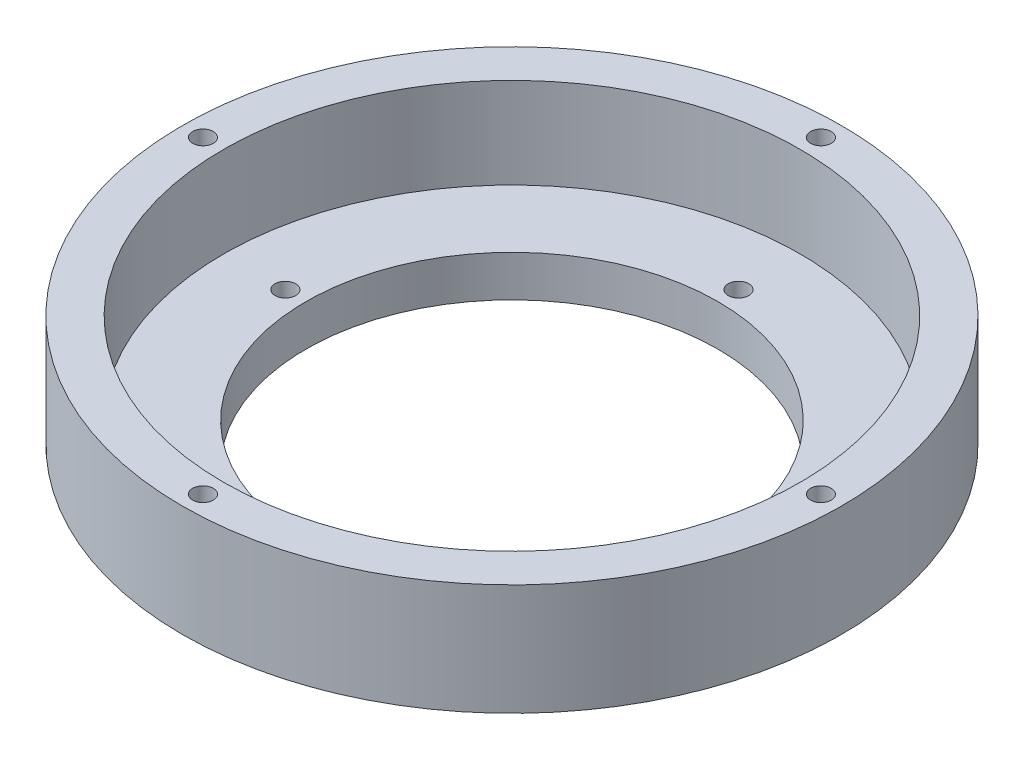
from build123d import *

# Parameters (mm, degrees)
SKETCH2_R           = 60
SKETCH2_R_2         = 50
BOSS_EXTRUDE1_DEPTH = 5
SKETCH7_R           = 80
SKETCH7_R_2         = 50
BOSS_EXTRUDE2_DEPTH = 5
SKETCH8_R           = 80
SKETCH8_R_2         = 70
BOSS_EXTRUDE3_DEPTH = 22
CUT_EXTRUDE3_REACH  = 119.576
SKETCH4_R           = 2.5
SKETCH9_R           = 2.5
CUT_EXTRUDE4_DEPTH  = 10


with BuildPart() as part:
    # Sketch2 → Boss-Extrude1 (new body)
    with BuildSketch(Plane(origin=(0, 0, 0), x_dir=(1, 0, 0), z_dir=(0, 1, 0))):
        with Locations(Location((0, 0, 0), (0, 0, 270))):
            Circle(SKETCH2_R)
        with Locations(Location((0, 0, 0), (0, 0, 270))):
            Circle(SKETCH2_R_2, mode=Mode.SUBTRACT)
    extrude(amount=BOSS_EXTRUDE1_DEPTH)

    # Sketch7 → Boss-Extrude2 (add)
    with BuildSketch(Plane(origin=(0, 5, 0), x_dir=(1, 0, 0), z_dir=(0, 1, 0))):
        with Locations(Location((0, 0, 0), (0, 0, 270))):
            Circle(SKETCH7_R)
        with Locations(Location((0, 0, 0), (0, 0, 270))):
            Circle(SKETCH7_R_2, mode=Mode.SUBTRACT)
    extrude(amount=BOSS_EXTRUDE2_DEPTH)

    # Sketch8 → Boss-Extrude3 (add)
    with BuildSketch(Plane(origin=(0, 10, 0), x_dir=(1, 0, 0), z_dir=(0, 1, 0))):
        with Locations(Location((0, 0, 0), (0, 0, 270))):
            Circle(SKETCH8_R)
        with Locations(Location((0, 0, 0), (0, 0, 270))):
            Circle(SKETCH8_R_2, mode=Mode.SUBTRACT)
    extrude(amount=BOSS_EXTRUDE3_DEPTH)

    # Sketch4 → Cut-Extrude3 (cut, up to next)
    with BuildSketch(Plane.XZ, mode=Mode.PRIVATE) as cut_extrude3_sk1:
        with Locations(Location((-55, 0, 0), (0, 0, 270))):
            Circle(SKETCH4_R)
    cut_extrude3_tool1 = extrude(cut_extrude3_sk1.sketch, amount=-CUT_EXTRUDE3_REACH, mode=Mode.PRIVATE) & part.part
    # Sketch4 → Cut-Extrude3 (cut, up to next)
    with BuildSketch(Plane.XZ, mode=Mode.PRIVATE) as cut_extrude3_sk2:
        with Locations(Location((0, 55, 0), (0, 0, 270))):
            Circle(SKETCH4_R)
    cut_extrude3_tool2 = extrude(cut_extrude3_sk2.sketch, amount=-CUT_EXTRUDE3_REACH, mode=Mode.PRIVATE) & part.part
    # Sketch4 → Cut-Extrude3 (cut, up to next)
    with BuildSketch(Plane.XZ, mode=Mode.PRIVATE) as cut_extrude3_sk3:
        with Locations(Location((0, -55, 0), (0, 0, 270))):
            Circle(SKETCH4_R)
    cut_extrude3_tool3 = extrude(cut_extrude3_sk3.sketch, amount=-CUT_EXTRUDE3_REACH, mode=Mode.PRIVATE) & part.part
    # Sketch4 → Cut-Extrude3 (cut, up to next)
    with BuildSketch(Plane.XZ, mode=Mode.PRIVATE) as cut_extrude3_sk4:
        with Locations(Location((55, 0, 0), (0, 0, 270))):
            Circle(SKETCH4_R)
    cut_extrude3_tool4 = extrude(cut_extrude3_sk4.sketch, amount=-CUT_EXTRUDE3_REACH, mode=Mode.PRIVATE) & part.part
    add(cut_extrude3_tool1.solids().sort_by_distance((-55, 0, 0))[0], mode=Mode.SUBTRACT)
    add(cut_extrude3_tool2.solids().sort_by_distance((0, 0, 55))[0], mode=Mode.SUBTRACT)
    add(cut_extrude3_tool3.solids().sort_by_distance((0, 0, -55))[0], mode=Mode.SUBTRACT)
    add(cut_extrude3_tool4.solids().sort_by_distance((55, 0, 0))[0], mode=Mode.SUBTRACT)

    # Sketch9 → Cut-Extrude4 (cut)
    with BuildSketch(Plane(origin=(0, 32, 0), x_dir=(1, 0, 0), z_dir=(0, 1, 0))):
        with Locations(Location((-75, 0, 0), (0, 0, 270))):
            Circle(SKETCH9_R)
        with Locations(Location((0, 75, 0), (0, 0, 270))):
            Circle(SKETCH9_R)
        with Locations(Location((0, -75, 0), (0, 0, 270))):
            Circle(SKETCH9_R)
        with Locations(Location((75, 0, 0), (0, 0, 270))):
            Circle(SKETCH9_R)
    extrude(amount=-CUT_EXTRUDE4_DEPTH, mode=Mode.SUBTRACT)


solid = part.part
